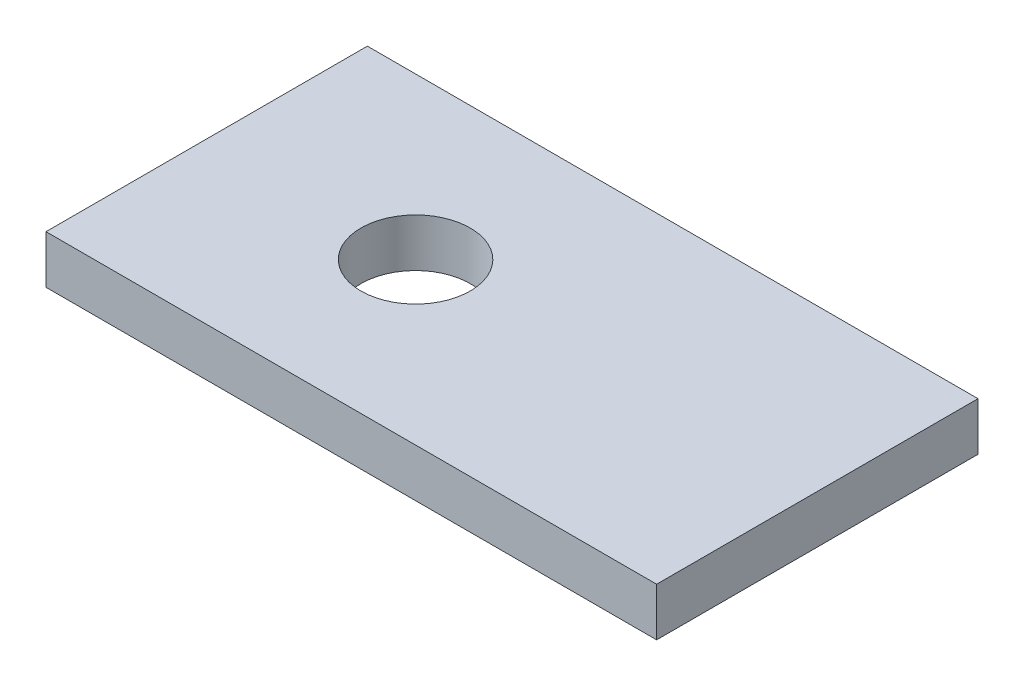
ISO-10303-21;
HEADER;
FILE_DESCRIPTION(('STEP AP214'),'2;1');
FILE_NAME('part.step','',(''),(''),'','','');
FILE_SCHEMA(('AUTOMOTIVE_DESIGN { 1 0 10303 214 1 1 1 1 }'));
ENDSEC;
DATA;
#1=APPLICATION_CONTEXT('core data for automotive mechanical design processes');
#2=APPLICATION_PROTOCOL_DEFINITION('international standard','automotive_design',2000,#1);
#3=PRODUCT_CONTEXT('',#1,'mechanical');
#4=PRODUCT('Part','Part','',(#3));
#5=PRODUCT_RELATED_PRODUCT_CATEGORY('part','',(#4));
#6=PRODUCT_DEFINITION_FORMATION('','',#4);
#7=PRODUCT_DEFINITION_CONTEXT('part definition',#1,'design');
#8=PRODUCT_DEFINITION('design','',#6,#7);
#9=PRODUCT_DEFINITION_SHAPE('','',#8);
#10=(LENGTH_UNIT() NAMED_UNIT(*) SI_UNIT(.MILLI.,.METRE.));
#11=(NAMED_UNIT(*) PLANE_ANGLE_UNIT() SI_UNIT($,.RADIAN.));
#12=(NAMED_UNIT(*) SI_UNIT($,.STERADIAN.) SOLID_ANGLE_UNIT());
#13=UNCERTAINTY_MEASURE_WITH_UNIT(LENGTH_MEASURE(1.E-05),#10,'distance_accuracy_value','');
#14=(GEOMETRIC_REPRESENTATION_CONTEXT(3) GLOBAL_UNCERTAINTY_ASSIGNED_CONTEXT((#13)) GLOBAL_UNIT_ASSIGNED_CONTEXT((#10,
#11,#12)) REPRESENTATION_CONTEXT('',''));
#15=CARTESIAN_POINT('',(0.,0.,0.));
#16=DIRECTION('',(0.,0.,1.));
#17=DIRECTION('',(1.,0.,0.));
#18=AXIS2_PLACEMENT_3D('',#15,#16,#17);
#19=CARTESIAN_POINT('',(0.,3.,0.));
#20=DIRECTION('',(1.,0.,0.));
#21=DIRECTION('',(0.,0.,-1.));
#22=AXIS2_PLACEMENT_3D('',#19,#20,#21);
#23=PLANE('',#22);
#24=DIRECTION('',(0.,0.,1.));
#25=VECTOR('',#24,1.);
#26=CARTESIAN_POINT('',(0.,0.,0.));
#27=LINE('',#26,#25);
#28=CARTESIAN_POINT('',(0.,0.,-20.));
#29=VERTEX_POINT('',#28);
#30=CARTESIAN_POINT('',(0.,0.,0.));
#31=VERTEX_POINT('',#30);
#32=EDGE_CURVE('E97',#29,#31,#27,.T.);
#33=ORIENTED_EDGE('',*,*,#32,.T.);
#34=DIRECTION('',(0.,-1.,0.));
#35=VECTOR('',#34,1.);
#36=CARTESIAN_POINT('',(0.,3.,0.));
#37=LINE('',#36,#35);
#38=CARTESIAN_POINT('',(0.,3.,0.));
#39=VERTEX_POINT('',#38);
#40=EDGE_CURVE('E11',#39,#31,#37,.T.);
#41=ORIENTED_EDGE('',*,*,#40,.F.);
#42=DIRECTION('',(0.,0.,1.));
#43=VECTOR('',#42,1.);
#44=CARTESIAN_POINT('',(0.,3.,0.));
#45=LINE('',#44,#43);
#46=CARTESIAN_POINT('',(0.,3.,-20.));
#47=VERTEX_POINT('',#46);
#48=EDGE_CURVE('E85',#47,#39,#45,.T.);
#49=ORIENTED_EDGE('',*,*,#48,.F.);
#50=DIRECTION('',(0.,-1.,0.));
#51=VECTOR('',#50,1.);
#52=CARTESIAN_POINT('',(0.,3.,-20.));
#53=LINE('',#52,#51);
#54=EDGE_CURVE('E93',#47,#29,#53,.T.);
#55=ORIENTED_EDGE('',*,*,#54,.T.);
#56=EDGE_LOOP('',(#33,#41,#49,#55));
#57=FACE_BOUND('',#56,.T.);
#58=ADVANCED_FACE('F34',(#57),#23,.F.);
#59=CARTESIAN_POINT('',(0.,3.,0.));
#60=DIRECTION('',(0.,0.,-1.));
#61=DIRECTION('',(-1.,0.,0.));
#62=AXIS2_PLACEMENT_3D('',#59,#60,#61);
#63=PLANE('',#62);
#64=DIRECTION('',(1.,0.,0.));
#65=VECTOR('',#64,1.);
#66=CARTESIAN_POINT('',(0.,0.,0.));
#67=LINE('',#66,#65);
#68=CARTESIAN_POINT('',(38.,0.,0.));
#69=VERTEX_POINT('',#68);
#70=EDGE_CURVE('E89',#31,#69,#67,.T.);
#71=ORIENTED_EDGE('',*,*,#70,.T.);
#72=DIRECTION('',(0.,-1.,0.));
#73=VECTOR('',#72,1.);
#74=CARTESIAN_POINT('',(38.,3.,0.));
#75=LINE('',#74,#73);
#76=CARTESIAN_POINT('',(38.,3.,0.));
#77=VERTEX_POINT('',#76);
#78=EDGE_CURVE('E42',#77,#69,#75,.T.);
#79=ORIENTED_EDGE('',*,*,#78,.F.);
#80=DIRECTION('',(1.,0.,0.));
#81=VECTOR('',#80,1.);
#82=CARTESIAN_POINT('',(0.,3.,0.));
#83=LINE('',#82,#81);
#84=EDGE_CURVE('E80',#39,#77,#83,.T.);
#85=ORIENTED_EDGE('',*,*,#84,.F.);
#86=ORIENTED_EDGE('',*,*,#40,.T.);
#87=EDGE_LOOP('',(#71,#79,#85,#86));
#88=FACE_BOUND('',#87,.T.);
#89=ADVANCED_FACE('F88',(#88),#63,.F.);
#90=CARTESIAN_POINT('',(38.,3.,0.));
#91=DIRECTION('',(-1.,0.,0.));
#92=DIRECTION('',(0.,0.,1.));
#93=AXIS2_PLACEMENT_3D('',#90,#91,#92);
#94=PLANE('',#93);
#95=DIRECTION('',(0.,0.,-1.));
#96=VECTOR('',#95,1.);
#97=CARTESIAN_POINT('',(38.,0.,0.));
#98=LINE('',#97,#96);
#99=CARTESIAN_POINT('',(38.,0.,-20.));
#100=VERTEX_POINT('',#99);
#101=EDGE_CURVE('E67',#69,#100,#98,.T.);
#102=ORIENTED_EDGE('',*,*,#101,.T.);
#103=DIRECTION('',(0.,-1.,0.));
#104=VECTOR('',#103,1.);
#105=CARTESIAN_POINT('',(38.,3.,-20.));
#106=LINE('',#105,#104);
#107=CARTESIAN_POINT('',(38.,3.,-20.));
#108=VERTEX_POINT('',#107);
#109=EDGE_CURVE('E90',#108,#100,#106,.T.);
#110=ORIENTED_EDGE('',*,*,#109,.F.);
#111=DIRECTION('',(0.,0.,-1.));
#112=VECTOR('',#111,1.);
#113=CARTESIAN_POINT('',(38.,3.,0.));
#114=LINE('',#113,#112);
#115=EDGE_CURVE('E83',#77,#108,#114,.T.);
#116=ORIENTED_EDGE('',*,*,#115,.F.);
#117=ORIENTED_EDGE('',*,*,#78,.T.);
#118=EDGE_LOOP('',(#102,#110,#116,#117));
#119=FACE_BOUND('',#118,.T.);
#120=ADVANCED_FACE('F91',(#119),#94,.F.);
#121=CARTESIAN_POINT('',(0.,3.,-20.));
#122=DIRECTION('',(0.,0.,1.));
#123=DIRECTION('',(1.,0.,0.));
#124=AXIS2_PLACEMENT_3D('',#121,#122,#123);
#125=PLANE('',#124);
#126=DIRECTION('',(-1.,0.,0.));
#127=VECTOR('',#126,1.);
#128=CARTESIAN_POINT('',(0.,0.,-20.));
#129=LINE('',#128,#127);
#130=EDGE_CURVE('E73',#100,#29,#129,.T.);
#131=ORIENTED_EDGE('',*,*,#130,.T.);
#132=ORIENTED_EDGE('',*,*,#54,.F.);
#133=DIRECTION('',(-1.,0.,0.));
#134=VECTOR('',#133,1.);
#135=CARTESIAN_POINT('',(0.,3.,-20.));
#136=LINE('',#135,#134);
#137=EDGE_CURVE('E50',#108,#47,#136,.T.);
#138=ORIENTED_EDGE('',*,*,#137,.F.);
#139=ORIENTED_EDGE('',*,*,#109,.T.);
#140=EDGE_LOOP('',(#131,#132,#138,#139));
#141=FACE_BOUND('',#140,.T.);
#142=ADVANCED_FACE('F105',(#141),#125,.F.);
#143=CARTESIAN_POINT('',(0.,3.,-20.));
#144=DIRECTION('',(0.,-1.,0.));
#145=DIRECTION('',(0.,0.,-1.));
#146=AXIS2_PLACEMENT_3D('',#143,#144,#145);
#147=PLANE('',#146);
#148=CARTESIAN_POINT('',(13.,3.,-10.));
#149=DIRECTION('',(0.,1.,0.));
#150=DIRECTION('',(0.,0.,1.));
#151=AXIS2_PLACEMENT_3D('',#148,#149,#150);
#152=CIRCLE('',#151,3.39999999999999);
#153=CARTESIAN_POINT('',(13.,3.,-6.60000000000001));
#154=VERTEX_POINT('',#153);
#155=EDGE_CURVE('E113',#154,#154,#152,.T.);
#156=ORIENTED_EDGE('',*,*,#155,.F.);
#157=EDGE_LOOP('',(#156));
#158=FACE_BOUND('',#157,.T.);
#159=ORIENTED_EDGE('',*,*,#48,.T.);
#160=ORIENTED_EDGE('',*,*,#84,.T.);
#161=ORIENTED_EDGE('',*,*,#115,.T.);
#162=ORIENTED_EDGE('',*,*,#137,.T.);
#163=EDGE_LOOP('',(#159,#160,#161,#162));
#164=FACE_BOUND('',#163,.T.);
#165=ADVANCED_FACE('F81',(#158,#164),#147,.F.);
#166=CARTESIAN_POINT('',(0.,0.,-20.));
#167=DIRECTION('',(0.,-1.,0.));
#168=DIRECTION('',(0.,0.,-1.));
#169=AXIS2_PLACEMENT_3D('',#166,#167,#168);
#170=PLANE('',#169);
#171=CARTESIAN_POINT('',(13.,0.,-10.));
#172=DIRECTION('',(0.,1.,0.));
#173=DIRECTION('',(0.,0.,1.));
#174=AXIS2_PLACEMENT_3D('',#171,#172,#173);
#175=CIRCLE('',#174,3.4);
#176=CARTESIAN_POINT('',(13.,0.,-6.6));
#177=VERTEX_POINT('',#176);
#178=EDGE_CURVE('E100',#177,#177,#175,.T.);
#179=ORIENTED_EDGE('',*,*,#178,.T.);
#180=EDGE_LOOP('',(#179));
#181=FACE_BOUND('',#180,.T.);
#182=ORIENTED_EDGE('',*,*,#32,.F.);
#183=ORIENTED_EDGE('',*,*,#130,.F.);
#184=ORIENTED_EDGE('',*,*,#101,.F.);
#185=ORIENTED_EDGE('',*,*,#70,.F.);
#186=EDGE_LOOP('',(#182,#183,#184,#185));
#187=FACE_BOUND('',#186,.T.);
#188=ADVANCED_FACE('F108',(#181,#187),#170,.T.);
#189=CARTESIAN_POINT('',(13.,3.,-10.));
#190=DIRECTION('',(0.,1.,0.));
#191=DIRECTION('',(0.,0.,1.));
#192=AXIS2_PLACEMENT_3D('',#189,#190,#191);
#193=CYLINDRICAL_SURFACE('',#192,3.39999999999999);
#194=ORIENTED_EDGE('',*,*,#178,.F.);
#195=EDGE_LOOP('',(#194));
#196=FACE_BOUND('',#195,.T.);
#197=ORIENTED_EDGE('',*,*,#155,.T.);
#198=EDGE_LOOP('',(#197));
#199=FACE_BOUND('',#198,.T.);
#200=ADVANCED_FACE('F117',(#196,#199),#193,.F.);
#201=CLOSED_SHELL('',(#58,#89,#120,#142,#165,#188,#200));
#202=MANIFOLD_SOLID_BREP('B2',#201);
#203=ADVANCED_BREP_SHAPE_REPRESENTATION('',(#18,#202),#14);
#204=SHAPE_DEFINITION_REPRESENTATION(#9,#203);
ENDSEC;
END-ISO-10303-21;
